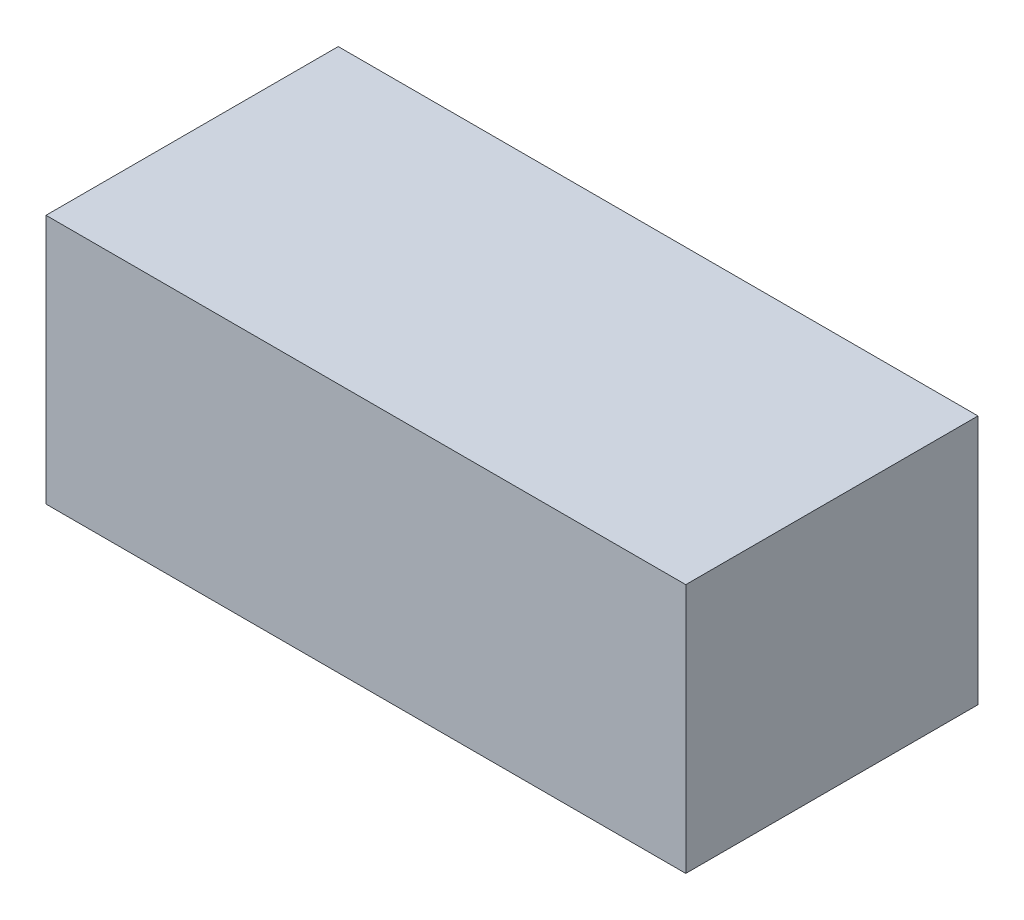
from build123d import *

# Parameters (mm, degrees)
SKETCH1_W      = 24.3
SKETCH1_H      = 11.1
EXTRUDE1_DEPTH = 9.5


with BuildPart() as part:
    # Sketch1 → Extrude1 (new body)
    with BuildSketch(Plane(origin=(0, 0, 0), x_dir=(1, 0, 0), z_dir=(0, 1, 0))):
        with Locations((12.15, 5.55)):
            Rectangle(SKETCH1_W, SKETCH1_H)
    extrude(amount=EXTRUDE1_DEPTH)


solid = part.part
